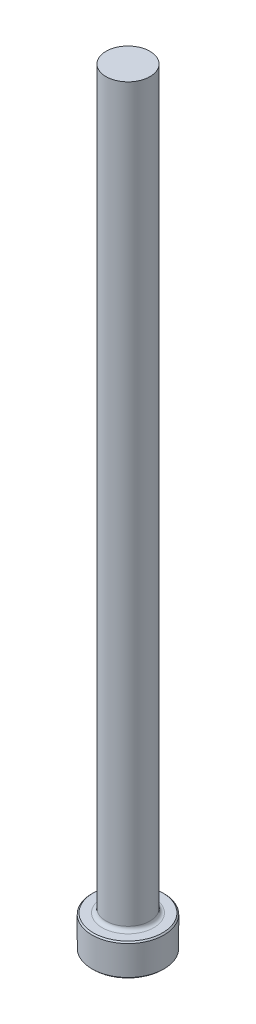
ISO-10303-21;
HEADER;
FILE_DESCRIPTION(('STEP AP214'),'2;1');
FILE_NAME('part.step','',(''),(''),'','','');
FILE_SCHEMA(('AUTOMOTIVE_DESIGN { 1 0 10303 214 1 1 1 1 }'));
ENDSEC;
DATA;
#1=APPLICATION_CONTEXT('core data for automotive mechanical design processes');
#2=APPLICATION_PROTOCOL_DEFINITION('international standard','automotive_design',2000,#1);
#3=PRODUCT_CONTEXT('',#1,'mechanical');
#4=PRODUCT('Part','Part','',(#3));
#5=PRODUCT_RELATED_PRODUCT_CATEGORY('part','',(#4));
#6=PRODUCT_DEFINITION_FORMATION('','',#4);
#7=PRODUCT_DEFINITION_CONTEXT('part definition',#1,'design');
#8=PRODUCT_DEFINITION('design','',#6,#7);
#9=PRODUCT_DEFINITION_SHAPE('','',#8);
#10=(LENGTH_UNIT() NAMED_UNIT(*) SI_UNIT(.MILLI.,.METRE.));
#11=(NAMED_UNIT(*) PLANE_ANGLE_UNIT() SI_UNIT($,.RADIAN.));
#12=(NAMED_UNIT(*) SI_UNIT($,.STERADIAN.) SOLID_ANGLE_UNIT());
#13=UNCERTAINTY_MEASURE_WITH_UNIT(LENGTH_MEASURE(1.E-05),#10,'distance_accuracy_value','');
#14=(GEOMETRIC_REPRESENTATION_CONTEXT(3) GLOBAL_UNCERTAINTY_ASSIGNED_CONTEXT((#13)) GLOBAL_UNIT_ASSIGNED_CONTEXT((#10,
#11,#12)) REPRESENTATION_CONTEXT('',''));
#15=CARTESIAN_POINT('',(0.,0.,0.));
#16=DIRECTION('',(0.,0.,1.));
#17=DIRECTION('',(1.,0.,0.));
#18=AXIS2_PLACEMENT_3D('',#15,#16,#17);
#19=CARTESIAN_POINT('',(0.,0.,0.));
#20=DIRECTION('',(0.,-1.,0.));
#21=DIRECTION('',(0.,0.,-1.));
#22=AXIS2_PLACEMENT_3D('',#19,#20,#21);
#23=PLANE('',#22);
#24=CARTESIAN_POINT('',(0.,0.,0.));
#25=DIRECTION('',(0.,-1.,0.));
#26=DIRECTION('',(0.,0.,-1.));
#27=AXIS2_PLACEMENT_3D('',#24,#25,#26);
#28=CIRCLE('',#27,6.88339999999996);
#29=CARTESIAN_POINT('',(0.,0.,-6.88339999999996));
#30=VERTEX_POINT('',#29);
#31=EDGE_CURVE('E41',#30,#30,#28,.T.);
#32=ORIENTED_EDGE('',*,*,#31,.T.);
#33=EDGE_LOOP('',(#32));
#34=FACE_BOUND('',#33,.T.);
#35=ADVANCED_FACE('F30',(#34),#23,.T.);
#36=CARTESIAN_POINT('',(0.,259.958771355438,0.));
#37=DIRECTION('',(0.,1.,0.));
#38=DIRECTION('',(0.,0.,1.));
#39=AXIS2_PLACEMENT_3D('',#36,#37,#38);
#40=CYLINDRICAL_SURFACE('',#39,7.13739999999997);
#41=CARTESIAN_POINT('',(0.,6.09599999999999,0.));
#42=DIRECTION('',(0.,1.,0.));
#43=DIRECTION('',(0.,0.,1.));
#44=AXIS2_PLACEMENT_3D('',#41,#42,#43);
#45=CIRCLE('',#44,7.13739999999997);
#46=CARTESIAN_POINT('',(0.,6.09599999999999,7.13739999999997));
#47=VERTEX_POINT('',#46);
#48=EDGE_CURVE('E45',#47,#47,#45,.F.);
#49=ORIENTED_EDGE('',*,*,#48,.T.);
#50=EDGE_LOOP('',(#49));
#51=FACE_BOUND('',#50,.T.);
#52=CARTESIAN_POINT('',(0.,0.254000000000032,0.));
#53=DIRECTION('',(0.,-1.,0.));
#54=DIRECTION('',(0.,0.,-1.));
#55=AXIS2_PLACEMENT_3D('',#52,#53,#54);
#56=CIRCLE('',#55,7.13739999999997);
#57=CARTESIAN_POINT('',(0.,0.254000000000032,-7.13739999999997));
#58=VERTEX_POINT('',#57);
#59=EDGE_CURVE('E50',#58,#58,#56,.F.);
#60=ORIENTED_EDGE('',*,*,#59,.T.);
#61=EDGE_LOOP('',(#60));
#62=FACE_BOUND('',#61,.T.);
#63=ADVANCED_FACE('F72',(#51,#62),#40,.T.);
#64=CARTESIAN_POINT('',(-7.13739999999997,6.35,0.));
#65=DIRECTION('',(0.,1.,0.));
#66=DIRECTION('',(0.,0.,1.));
#67=AXIS2_PLACEMENT_3D('',#64,#65,#66);
#68=PLANE('',#67);
#69=CARTESIAN_POINT('',(0.,6.35,0.));
#70=DIRECTION('',(0.,1.,0.));
#71=DIRECTION('',(0.,0.,1.));
#72=AXIS2_PLACEMENT_3D('',#69,#70,#71);
#73=CIRCLE('',#72,5.12698999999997);
#74=CARTESIAN_POINT('',(0.,6.35,5.12698999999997));
#75=VERTEX_POINT('',#74);
#76=EDGE_CURVE('E10',#75,#75,#73,.F.);
#77=ORIENTED_EDGE('',*,*,#76,.T.);
#78=EDGE_LOOP('',(#77));
#79=FACE_BOUND('',#78,.T.);
#80=CARTESIAN_POINT('',(0.,6.35,0.));
#81=DIRECTION('',(0.,1.,0.));
#82=DIRECTION('',(0.,0.,1.));
#83=AXIS2_PLACEMENT_3D('',#80,#81,#82);
#84=CIRCLE('',#83,6.88340000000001);
#85=CARTESIAN_POINT('',(0.,6.35,6.88340000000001));
#86=VERTEX_POINT('',#85);
#87=EDGE_CURVE('E53',#86,#86,#84,.T.);
#88=ORIENTED_EDGE('',*,*,#87,.T.);
#89=EDGE_LOOP('',(#88));
#90=FACE_BOUND('',#89,.T.);
#91=ADVANCED_FACE('F64',(#79,#90),#68,.T.);
#92=CARTESIAN_POINT('',(0.,259.958771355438,0.));
#93=DIRECTION('',(0.,1.,0.));
#94=DIRECTION('',(0.,0.,1.));
#95=AXIS2_PLACEMENT_3D('',#92,#93,#94);
#96=CYLINDRICAL_SURFACE('',#95,4.36498999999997);
#97=CARTESIAN_POINT('',(0.,7.11200000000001,0.));
#98=DIRECTION('',(0.,1.,0.));
#99=DIRECTION('',(0.,0.,1.));
#100=AXIS2_PLACEMENT_3D('',#97,#98,#99);
#101=CIRCLE('',#100,4.36498999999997);
#102=CARTESIAN_POINT('',(0.,7.11200000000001,4.36498999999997));
#103=VERTEX_POINT('',#102);
#104=EDGE_CURVE('E37',#103,#103,#101,.T.);
#105=ORIENTED_EDGE('',*,*,#104,.T.);
#106=EDGE_LOOP('',(#105));
#107=FACE_BOUND('',#106,.T.);
#108=CARTESIAN_POINT('',(0.,152.4,0.));
#109=DIRECTION('',(0.,1.,0.));
#110=DIRECTION('',(0.,0.,1.));
#111=AXIS2_PLACEMENT_3D('',#108,#109,#110);
#112=CIRCLE('',#111,4.36498999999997);
#113=CARTESIAN_POINT('',(0.,152.4,4.36498999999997));
#114=VERTEX_POINT('',#113);
#115=EDGE_CURVE('E56',#114,#114,#112,.T.);
#116=ORIENTED_EDGE('',*,*,#115,.F.);
#117=EDGE_LOOP('',(#116));
#118=FACE_BOUND('',#117,.T.);
#119=ADVANCED_FACE('F62',(#107,#118),#96,.T.);
#120=CARTESIAN_POINT('',(-4.36498999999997,152.4,0.));
#121=DIRECTION('',(0.,1.,0.));
#122=DIRECTION('',(0.,0.,1.));
#123=AXIS2_PLACEMENT_3D('',#120,#121,#122);
#124=PLANE('',#123);
#125=ORIENTED_EDGE('',*,*,#115,.T.);
#126=EDGE_LOOP('',(#125));
#127=FACE_BOUND('',#126,.T.);
#128=ADVANCED_FACE('F60',(#127),#124,.T.);
#129=CARTESIAN_POINT('',(0.,6.35000000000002,0.));
#130=DIRECTION('',(0.,-1.,0.));
#131=DIRECTION('',(0.,0.,-1.));
#132=AXIS2_PLACEMENT_3D('',#129,#130,#131);
#133=CONICAL_SURFACE('',#132,6.88339999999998,0.785398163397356);
#134=ORIENTED_EDGE('',*,*,#48,.F.);
#135=EDGE_LOOP('',(#134));
#136=FACE_BOUND('',#135,.T.);
#137=ORIENTED_EDGE('',*,*,#87,.F.);
#138=EDGE_LOOP('',(#137));
#139=FACE_BOUND('',#138,.T.);
#140=ADVANCED_FACE('F70',(#136,#139),#133,.T.);
#141=CARTESIAN_POINT('',(0.,0.254000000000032,0.));
#142=DIRECTION('',(0.,1.,0.));
#143=DIRECTION('',(0.,0.,1.));
#144=AXIS2_PLACEMENT_3D('',#141,#142,#143);
#145=CONICAL_SURFACE('',#144,7.13739999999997,0.785398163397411);
#146=ORIENTED_EDGE('',*,*,#31,.F.);
#147=EDGE_LOOP('',(#146));
#148=FACE_BOUND('',#147,.T.);
#149=ORIENTED_EDGE('',*,*,#59,.F.);
#150=EDGE_LOOP('',(#149));
#151=FACE_BOUND('',#150,.T.);
#152=ADVANCED_FACE('F84',(#148,#151),#145,.T.);
#153=CARTESIAN_POINT('',(0.,7.11200000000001,0.));
#154=DIRECTION('',(0.,1.,0.));
#155=DIRECTION('',(0.,0.,1.));
#156=AXIS2_PLACEMENT_3D('',#153,#154,#155);
#157=TOROIDAL_SURFACE('',#156,5.12698999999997,0.762);
#158=ORIENTED_EDGE('',*,*,#76,.F.);
#159=EDGE_LOOP('',(#158));
#160=FACE_BOUND('',#159,.T.);
#161=ORIENTED_EDGE('',*,*,#104,.F.);
#162=EDGE_LOOP('',(#161));
#163=FACE_BOUND('',#162,.T.);
#164=ADVANCED_FACE('F32',(#160,#163),#157,.F.);
#165=CLOSED_SHELL('',(#35,#63,#91,#119,#128,#140,#152,#164));
#166=MANIFOLD_SOLID_BREP('B2',#165);
#167=ADVANCED_BREP_SHAPE_REPRESENTATION('',(#18,#166),#14);
#168=SHAPE_DEFINITION_REPRESENTATION(#9,#167);
ENDSEC;
END-ISO-10303-21;
